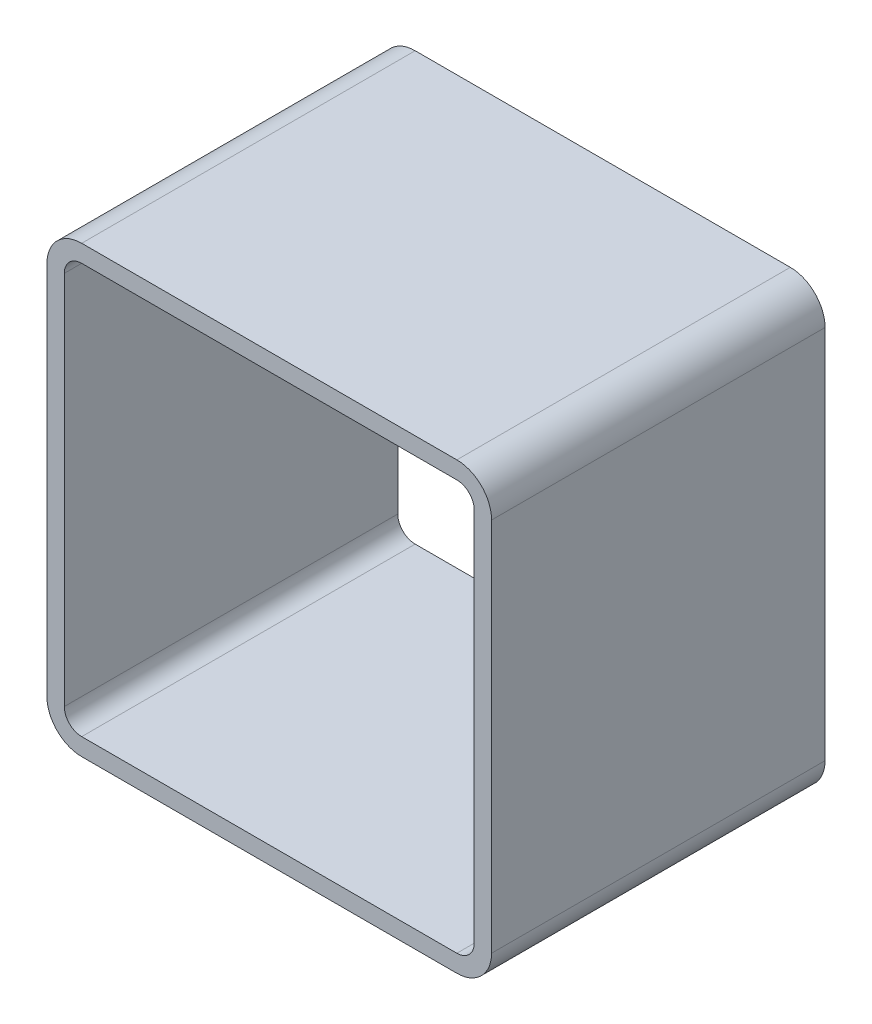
ISO-10303-21;
HEADER;
FILE_DESCRIPTION(('STEP AP214'),'2;1');
FILE_NAME('part.step','',(''),(''),'','','');
FILE_SCHEMA(('AUTOMOTIVE_DESIGN { 1 0 10303 214 1 1 1 1 }'));
ENDSEC;
DATA;
#1=APPLICATION_CONTEXT('core data for automotive mechanical design processes');
#2=APPLICATION_PROTOCOL_DEFINITION('international standard','automotive_design',2000,#1);
#3=PRODUCT_CONTEXT('',#1,'mechanical');
#4=PRODUCT('Part','Part','',(#3));
#5=PRODUCT_RELATED_PRODUCT_CATEGORY('part','',(#4));
#6=PRODUCT_DEFINITION_FORMATION('','',#4);
#7=PRODUCT_DEFINITION_CONTEXT('part definition',#1,'design');
#8=PRODUCT_DEFINITION('design','',#6,#7);
#9=PRODUCT_DEFINITION_SHAPE('','',#8);
#10=(LENGTH_UNIT() NAMED_UNIT(*) SI_UNIT(.MILLI.,.METRE.));
#11=(NAMED_UNIT(*) PLANE_ANGLE_UNIT() SI_UNIT($,.RADIAN.));
#12=(NAMED_UNIT(*) SI_UNIT($,.STERADIAN.) SOLID_ANGLE_UNIT());
#13=UNCERTAINTY_MEASURE_WITH_UNIT(LENGTH_MEASURE(1.E-05),#10,'distance_accuracy_value','');
#14=(GEOMETRIC_REPRESENTATION_CONTEXT(3) GLOBAL_UNCERTAINTY_ASSIGNED_CONTEXT((#13)) GLOBAL_UNIT_ASSIGNED_CONTEXT((#10,
#11,#12)) REPRESENTATION_CONTEXT('',''));
#15=CARTESIAN_POINT('',(0.,0.,0.));
#16=DIRECTION('',(0.,0.,1.));
#17=DIRECTION('',(1.,0.,0.));
#18=AXIS2_PLACEMENT_3D('',#15,#16,#17);
#19=CARTESIAN_POINT('',(375.472465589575,33.5328624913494,304.8));
#20=DIRECTION('',(0.,0.,1.));
#21=DIRECTION('',(1.,0.,0.));
#22=AXIS2_PLACEMENT_3D('',#19,#20,#21);
#23=PLANE('',#22);
#24=CARTESIAN_POINT('',(375.472465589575,33.5328624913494,304.8));
#25=DIRECTION('',(0.,0.,1.));
#26=DIRECTION('',(1.,0.,0.));
#27=AXIS2_PLACEMENT_3D('',#24,#25,#26);
#28=CIRCLE('',#27,31.75);
#29=CARTESIAN_POINT('',(375.472465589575,1.78286249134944,304.8));
#30=VERTEX_POINT('',#29);
#31=CARTESIAN_POINT('',(407.222465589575,33.5328624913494,304.8));
#32=VERTEX_POINT('',#31);
#33=EDGE_CURVE('E211',#30,#32,#28,.T.);
#34=ORIENTED_EDGE('',*,*,#33,.T.);
#35=DIRECTION('',(0.,1.,0.));
#36=VECTOR('',#35,1.);
#37=CARTESIAN_POINT('',(407.222465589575,376.432862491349,304.8));
#38=LINE('',#37,#36);
#39=CARTESIAN_POINT('',(407.222465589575,376.432862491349,304.8));
#40=VERTEX_POINT('',#39);
#41=EDGE_CURVE('E214',#32,#40,#38,.T.);
#42=ORIENTED_EDGE('',*,*,#41,.T.);
#43=CARTESIAN_POINT('',(375.472465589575,376.432862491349,304.8));
#44=DIRECTION('',(0.,0.,1.));
#45=DIRECTION('',(1.,0.,0.));
#46=AXIS2_PLACEMENT_3D('',#43,#44,#45);
#47=CIRCLE('',#46,31.75);
#48=CARTESIAN_POINT('',(375.472465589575,408.182862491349,304.8));
#49=VERTEX_POINT('',#48);
#50=EDGE_CURVE('E217',#40,#49,#47,.T.);
#51=ORIENTED_EDGE('',*,*,#50,.T.);
#52=DIRECTION('',(-1.,0.,0.));
#53=VECTOR('',#52,1.);
#54=CARTESIAN_POINT('',(32.572465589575,408.182862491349,304.8));
#55=LINE('',#54,#53);
#56=CARTESIAN_POINT('',(32.572465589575,408.182862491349,304.8));
#57=VERTEX_POINT('',#56);
#58=EDGE_CURVE('E219',#49,#57,#55,.T.);
#59=ORIENTED_EDGE('',*,*,#58,.T.);
#60=CARTESIAN_POINT('',(32.572465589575,376.432862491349,304.8));
#61=DIRECTION('',(0.,0.,1.));
#62=DIRECTION('',(1.,0.,0.));
#63=AXIS2_PLACEMENT_3D('',#60,#61,#62);
#64=CIRCLE('',#63,31.75);
#65=CARTESIAN_POINT('',(0.82246558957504,376.432862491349,304.8));
#66=VERTEX_POINT('',#65);
#67=EDGE_CURVE('E221',#57,#66,#64,.T.);
#68=ORIENTED_EDGE('',*,*,#67,.T.);
#69=DIRECTION('',(0.,-1.,0.));
#70=VECTOR('',#69,1.);
#71=CARTESIAN_POINT('',(0.82246558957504,33.5328624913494,304.8));
#72=LINE('',#71,#70);
#73=CARTESIAN_POINT('',(0.822465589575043,33.5328624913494,304.8));
#74=VERTEX_POINT('',#73);
#75=EDGE_CURVE('E223',#66,#74,#72,.T.);
#76=ORIENTED_EDGE('',*,*,#75,.T.);
#77=CARTESIAN_POINT('',(32.572465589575,33.5328624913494,304.8));
#78=DIRECTION('',(0.,0.,1.));
#79=DIRECTION('',(1.,0.,0.));
#80=AXIS2_PLACEMENT_3D('',#77,#78,#79);
#81=CIRCLE('',#80,31.75);
#82=CARTESIAN_POINT('',(32.572465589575,1.78286249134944,304.8));
#83=VERTEX_POINT('',#82);
#84=EDGE_CURVE('E225',#74,#83,#81,.T.);
#85=ORIENTED_EDGE('',*,*,#84,.T.);
#86=DIRECTION('',(1.,0.,0.));
#87=VECTOR('',#86,1.);
#88=CARTESIAN_POINT('',(375.472465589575,1.78286249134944,304.8));
#89=LINE('',#88,#87);
#90=EDGE_CURVE('E227',#83,#30,#89,.T.);
#91=ORIENTED_EDGE('',*,*,#90,.T.);
#92=EDGE_LOOP('',(#34,#42,#51,#59,#68,#76,#85,#91));
#93=FACE_BOUND('',#92,.T.);
#94=DIRECTION('',(0.,-1.,0.));
#95=VECTOR('',#94,1.);
#96=CARTESIAN_POINT('',(16.697465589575,33.5328624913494,304.8));
#97=LINE('',#96,#95);
#98=CARTESIAN_POINT('',(16.697465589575,376.432862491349,304.8));
#99=VERTEX_POINT('',#98);
#100=CARTESIAN_POINT('',(16.697465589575,33.5328624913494,304.8));
#101=VERTEX_POINT('',#100);
#102=EDGE_CURVE('E154',#99,#101,#97,.T.);
#103=ORIENTED_EDGE('',*,*,#102,.F.);
#104=CARTESIAN_POINT('',(32.572465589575,376.432862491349,304.8));
#105=DIRECTION('',(0.,0.,1.));
#106=DIRECTION('',(1.,0.,0.));
#107=AXIS2_PLACEMENT_3D('',#104,#105,#106);
#108=CIRCLE('',#107,15.875);
#109=CARTESIAN_POINT('',(32.572465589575,392.307862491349,304.8));
#110=VERTEX_POINT('',#109);
#111=EDGE_CURVE('E146',#110,#99,#108,.T.);
#112=ORIENTED_EDGE('',*,*,#111,.F.);
#113=DIRECTION('',(-1.,0.,0.));
#114=VECTOR('',#113,1.);
#115=CARTESIAN_POINT('',(32.572465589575,392.307862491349,304.8));
#116=LINE('',#115,#114);
#117=CARTESIAN_POINT('',(375.472465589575,392.307862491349,304.8));
#118=VERTEX_POINT('',#117);
#119=EDGE_CURVE('E179',#118,#110,#116,.T.);
#120=ORIENTED_EDGE('',*,*,#119,.F.);
#121=CARTESIAN_POINT('',(375.472465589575,376.432862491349,304.8));
#122=DIRECTION('',(0.,0.,1.));
#123=DIRECTION('',(1.,0.,0.));
#124=AXIS2_PLACEMENT_3D('',#121,#122,#123);
#125=CIRCLE('',#124,15.8750000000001);
#126=CARTESIAN_POINT('',(391.347465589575,376.432862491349,304.8));
#127=VERTEX_POINT('',#126);
#128=EDGE_CURVE('E177',#127,#118,#125,.T.);
#129=ORIENTED_EDGE('',*,*,#128,.F.);
#130=DIRECTION('',(0.,1.,0.));
#131=VECTOR('',#130,1.);
#132=CARTESIAN_POINT('',(391.347465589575,376.432862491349,304.8));
#133=LINE('',#132,#131);
#134=CARTESIAN_POINT('',(391.347465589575,33.5328624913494,304.8));
#135=VERTEX_POINT('',#134);
#136=EDGE_CURVE('E175',#135,#127,#133,.T.);
#137=ORIENTED_EDGE('',*,*,#136,.F.);
#138=CARTESIAN_POINT('',(375.472465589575,33.5328624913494,304.8));
#139=DIRECTION('',(0.,0.,1.));
#140=DIRECTION('',(1.,0.,0.));
#141=AXIS2_PLACEMENT_3D('',#138,#139,#140);
#142=CIRCLE('',#141,15.875);
#143=CARTESIAN_POINT('',(375.472465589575,17.6578624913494,304.8));
#144=VERTEX_POINT('',#143);
#145=EDGE_CURVE('E173',#144,#135,#142,.T.);
#146=ORIENTED_EDGE('',*,*,#145,.F.);
#147=DIRECTION('',(1.,0.,0.));
#148=VECTOR('',#147,1.);
#149=CARTESIAN_POINT('',(375.472465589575,17.6578624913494,304.8));
#150=LINE('',#149,#148);
#151=CARTESIAN_POINT('',(32.572465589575,17.6578624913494,304.8));
#152=VERTEX_POINT('',#151);
#153=EDGE_CURVE('E169',#152,#144,#150,.T.);
#154=ORIENTED_EDGE('',*,*,#153,.F.);
#155=CARTESIAN_POINT('',(32.572465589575,33.5328624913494,304.8));
#156=DIRECTION('',(0.,0.,1.));
#157=DIRECTION('',(1.,0.,0.));
#158=AXIS2_PLACEMENT_3D('',#155,#156,#157);
#159=CIRCLE('',#158,15.875);
#160=EDGE_CURVE('E167',#101,#152,#159,.T.);
#161=ORIENTED_EDGE('',*,*,#160,.F.);
#162=EDGE_LOOP('',(#103,#112,#120,#129,#137,#146,#154,#161));
#163=FACE_BOUND('',#162,.T.);
#164=ADVANCED_FACE('F33',(#93,#163),#23,.T.);
#165=CARTESIAN_POINT('',(375.472465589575,33.5328624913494,0.));
#166=DIRECTION('',(0.,0.,1.));
#167=DIRECTION('',(1.,0.,0.));
#168=AXIS2_PLACEMENT_3D('',#165,#166,#167);
#169=PLANE('',#168);
#170=CARTESIAN_POINT('',(375.472465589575,33.5328624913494,0.));
#171=DIRECTION('',(0.,0.,1.));
#172=DIRECTION('',(1.,0.,0.));
#173=AXIS2_PLACEMENT_3D('',#170,#171,#172);
#174=CIRCLE('',#173,31.75);
#175=CARTESIAN_POINT('',(375.472465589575,1.78286249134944,0.));
#176=VERTEX_POINT('',#175);
#177=CARTESIAN_POINT('',(407.222465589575,33.5328624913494,0.));
#178=VERTEX_POINT('',#177);
#179=EDGE_CURVE('E162',#176,#178,#174,.T.);
#180=ORIENTED_EDGE('',*,*,#179,.F.);
#181=DIRECTION('',(1.,0.,0.));
#182=VECTOR('',#181,1.);
#183=CARTESIAN_POINT('',(375.472465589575,1.78286249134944,0.));
#184=LINE('',#183,#182);
#185=CARTESIAN_POINT('',(32.572465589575,1.78286249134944,0.));
#186=VERTEX_POINT('',#185);
#187=EDGE_CURVE('E215',#186,#176,#184,.T.);
#188=ORIENTED_EDGE('',*,*,#187,.F.);
#189=CARTESIAN_POINT('',(32.572465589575,33.5328624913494,0.));
#190=DIRECTION('',(0.,0.,1.));
#191=DIRECTION('',(1.,0.,0.));
#192=AXIS2_PLACEMENT_3D('',#189,#190,#191);
#193=CIRCLE('',#192,31.75);
#194=CARTESIAN_POINT('',(0.822465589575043,33.5328624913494,0.));
#195=VERTEX_POINT('',#194);
#196=EDGE_CURVE('E242',#195,#186,#193,.T.);
#197=ORIENTED_EDGE('',*,*,#196,.F.);
#198=DIRECTION('',(0.,-1.,0.));
#199=VECTOR('',#198,1.);
#200=CARTESIAN_POINT('',(0.82246558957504,33.5328624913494,0.));
#201=LINE('',#200,#199);
#202=CARTESIAN_POINT('',(0.82246558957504,376.432862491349,0.));
#203=VERTEX_POINT('',#202);
#204=EDGE_CURVE('E240',#203,#195,#201,.T.);
#205=ORIENTED_EDGE('',*,*,#204,.F.);
#206=CARTESIAN_POINT('',(32.572465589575,376.432862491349,0.));
#207=DIRECTION('',(0.,0.,1.));
#208=DIRECTION('',(1.,0.,0.));
#209=AXIS2_PLACEMENT_3D('',#206,#207,#208);
#210=CIRCLE('',#209,31.75);
#211=CARTESIAN_POINT('',(32.572465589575,408.182862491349,0.));
#212=VERTEX_POINT('',#211);
#213=EDGE_CURVE('E238',#212,#203,#210,.T.);
#214=ORIENTED_EDGE('',*,*,#213,.F.);
#215=DIRECTION('',(-1.,0.,0.));
#216=VECTOR('',#215,1.);
#217=CARTESIAN_POINT('',(32.572465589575,408.182862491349,0.));
#218=LINE('',#217,#216);
#219=CARTESIAN_POINT('',(375.472465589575,408.182862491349,0.));
#220=VERTEX_POINT('',#219);
#221=EDGE_CURVE('E236',#220,#212,#218,.T.);
#222=ORIENTED_EDGE('',*,*,#221,.F.);
#223=CARTESIAN_POINT('',(375.472465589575,376.432862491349,0.));
#224=DIRECTION('',(0.,0.,1.));
#225=DIRECTION('',(1.,0.,0.));
#226=AXIS2_PLACEMENT_3D('',#223,#224,#225);
#227=CIRCLE('',#226,31.75);
#228=CARTESIAN_POINT('',(407.222465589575,376.432862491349,0.));
#229=VERTEX_POINT('',#228);
#230=EDGE_CURVE('E234',#229,#220,#227,.T.);
#231=ORIENTED_EDGE('',*,*,#230,.F.);
#232=DIRECTION('',(0.,1.,0.));
#233=VECTOR('',#232,1.);
#234=CARTESIAN_POINT('',(407.222465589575,376.432862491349,0.));
#235=LINE('',#234,#233);
#236=EDGE_CURVE('E232',#178,#229,#235,.T.);
#237=ORIENTED_EDGE('',*,*,#236,.F.);
#238=EDGE_LOOP('',(#180,#188,#197,#205,#214,#222,#231,#237));
#239=FACE_BOUND('',#238,.T.);
#240=CARTESIAN_POINT('',(32.572465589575,376.432862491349,0.));
#241=DIRECTION('',(0.,0.,1.));
#242=DIRECTION('',(1.,0.,0.));
#243=AXIS2_PLACEMENT_3D('',#240,#241,#242);
#244=CIRCLE('',#243,15.875);
#245=CARTESIAN_POINT('',(32.572465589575,392.307862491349,0.));
#246=VERTEX_POINT('',#245);
#247=CARTESIAN_POINT('',(16.697465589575,376.432862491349,0.));
#248=VERTEX_POINT('',#247);
#249=EDGE_CURVE('E56',#246,#248,#244,.T.);
#250=ORIENTED_EDGE('',*,*,#249,.T.);
#251=DIRECTION('',(0.,-1.,0.));
#252=VECTOR('',#251,1.);
#253=CARTESIAN_POINT('',(16.697465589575,33.5328624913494,0.));
#254=LINE('',#253,#252);
#255=CARTESIAN_POINT('',(16.697465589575,33.5328624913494,0.));
#256=VERTEX_POINT('',#255);
#257=EDGE_CURVE('E161',#248,#256,#254,.T.);
#258=ORIENTED_EDGE('',*,*,#257,.T.);
#259=CARTESIAN_POINT('',(32.572465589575,33.5328624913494,0.));
#260=DIRECTION('',(0.,0.,1.));
#261=DIRECTION('',(1.,0.,0.));
#262=AXIS2_PLACEMENT_3D('',#259,#260,#261);
#263=CIRCLE('',#262,15.875);
#264=CARTESIAN_POINT('',(32.572465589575,17.6578624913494,0.));
#265=VERTEX_POINT('',#264);
#266=EDGE_CURVE('E183',#256,#265,#263,.T.);
#267=ORIENTED_EDGE('',*,*,#266,.T.);
#268=DIRECTION('',(1.,0.,0.));
#269=VECTOR('',#268,1.);
#270=CARTESIAN_POINT('',(375.472465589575,17.6578624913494,0.));
#271=LINE('',#270,#269);
#272=CARTESIAN_POINT('',(375.472465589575,17.6578624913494,0.));
#273=VERTEX_POINT('',#272);
#274=EDGE_CURVE('E186',#265,#273,#271,.T.);
#275=ORIENTED_EDGE('',*,*,#274,.T.);
#276=CARTESIAN_POINT('',(375.472465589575,33.5328624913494,0.));
#277=DIRECTION('',(0.,0.,1.));
#278=DIRECTION('',(1.,0.,0.));
#279=AXIS2_PLACEMENT_3D('',#276,#277,#278);
#280=CIRCLE('',#279,15.875);
#281=CARTESIAN_POINT('',(391.347465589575,33.5328624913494,0.));
#282=VERTEX_POINT('',#281);
#283=EDGE_CURVE('E189',#273,#282,#280,.T.);
#284=ORIENTED_EDGE('',*,*,#283,.T.);
#285=DIRECTION('',(0.,1.,0.));
#286=VECTOR('',#285,1.);
#287=CARTESIAN_POINT('',(391.347465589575,376.432862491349,0.));
#288=LINE('',#287,#286);
#289=CARTESIAN_POINT('',(391.347465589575,376.432862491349,0.));
#290=VERTEX_POINT('',#289);
#291=EDGE_CURVE('E192',#282,#290,#288,.T.);
#292=ORIENTED_EDGE('',*,*,#291,.T.);
#293=CARTESIAN_POINT('',(375.472465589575,376.432862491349,0.));
#294=DIRECTION('',(0.,0.,1.));
#295=DIRECTION('',(1.,0.,0.));
#296=AXIS2_PLACEMENT_3D('',#293,#294,#295);
#297=CIRCLE('',#296,15.8750000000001);
#298=CARTESIAN_POINT('',(375.472465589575,392.307862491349,0.));
#299=VERTEX_POINT('',#298);
#300=EDGE_CURVE('E195',#290,#299,#297,.T.);
#301=ORIENTED_EDGE('',*,*,#300,.T.);
#302=DIRECTION('',(-1.,0.,0.));
#303=VECTOR('',#302,1.);
#304=CARTESIAN_POINT('',(32.572465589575,392.307862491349,0.));
#305=LINE('',#304,#303);
#306=EDGE_CURVE('E155',#299,#246,#305,.T.);
#307=ORIENTED_EDGE('',*,*,#306,.T.);
#308=EDGE_LOOP('',(#250,#258,#267,#275,#284,#292,#301,#307));
#309=FACE_BOUND('',#308,.T.);
#310=ADVANCED_FACE('F272',(#239,#309),#169,.F.);
#311=CARTESIAN_POINT('',(375.472465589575,33.5328624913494,304.8));
#312=DIRECTION('',(0.,0.,-1.));
#313=DIRECTION('',(-1.,0.,0.));
#314=AXIS2_PLACEMENT_3D('',#311,#312,#313);
#315=CYLINDRICAL_SURFACE('',#314,31.75);
#316=ORIENTED_EDGE('',*,*,#179,.T.);
#317=DIRECTION('',(0.,0.,-1.));
#318=VECTOR('',#317,1.);
#319=CARTESIAN_POINT('',(407.222465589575,33.5328624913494,304.8));
#320=LINE('',#319,#318);
#321=EDGE_CURVE('E11',#32,#178,#320,.T.);
#322=ORIENTED_EDGE('',*,*,#321,.F.);
#323=ORIENTED_EDGE('',*,*,#33,.F.);
#324=DIRECTION('',(0.,0.,-1.));
#325=VECTOR('',#324,1.);
#326=CARTESIAN_POINT('',(375.472465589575,1.78286249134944,304.8));
#327=LINE('',#326,#325);
#328=EDGE_CURVE('E229',#30,#176,#327,.T.);
#329=ORIENTED_EDGE('',*,*,#328,.T.);
#330=EDGE_LOOP('',(#316,#322,#323,#329));
#331=FACE_BOUND('',#330,.T.);
#332=ADVANCED_FACE('F35',(#331),#315,.T.);
#333=CARTESIAN_POINT('',(407.222465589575,376.432862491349,304.8));
#334=DIRECTION('',(-1.,0.,0.));
#335=DIRECTION('',(0.,0.,1.));
#336=AXIS2_PLACEMENT_3D('',#333,#334,#335);
#337=PLANE('',#336);
#338=ORIENTED_EDGE('',*,*,#236,.T.);
#339=DIRECTION('',(0.,0.,-1.));
#340=VECTOR('',#339,1.);
#341=CARTESIAN_POINT('',(407.222465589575,376.432862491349,304.8));
#342=LINE('',#341,#340);
#343=EDGE_CURVE('E41',#40,#229,#342,.T.);
#344=ORIENTED_EDGE('',*,*,#343,.F.);
#345=ORIENTED_EDGE('',*,*,#41,.F.);
#346=ORIENTED_EDGE('',*,*,#321,.T.);
#347=EDGE_LOOP('',(#338,#344,#345,#346));
#348=FACE_BOUND('',#347,.T.);
#349=ADVANCED_FACE('F289',(#348),#337,.F.);
#350=CARTESIAN_POINT('',(375.472465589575,376.432862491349,304.8));
#351=DIRECTION('',(0.,0.,-1.));
#352=DIRECTION('',(-1.,0.,0.));
#353=AXIS2_PLACEMENT_3D('',#350,#351,#352);
#354=CYLINDRICAL_SURFACE('',#353,31.75);
#355=ORIENTED_EDGE('',*,*,#230,.T.);
#356=DIRECTION('',(0.,0.,-1.));
#357=VECTOR('',#356,1.);
#358=CARTESIAN_POINT('',(375.472465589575,408.182862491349,304.8));
#359=LINE('',#358,#357);
#360=EDGE_CURVE('E259',#49,#220,#359,.T.);
#361=ORIENTED_EDGE('',*,*,#360,.F.);
#362=ORIENTED_EDGE('',*,*,#50,.F.);
#363=ORIENTED_EDGE('',*,*,#343,.T.);
#364=EDGE_LOOP('',(#355,#361,#362,#363));
#365=FACE_BOUND('',#364,.T.);
#366=ADVANCED_FACE('F266',(#365),#354,.T.);
#367=CARTESIAN_POINT('',(32.572465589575,408.182862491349,304.8));
#368=DIRECTION('',(0.,-1.,0.));
#369=DIRECTION('',(0.,0.,-1.));
#370=AXIS2_PLACEMENT_3D('',#367,#368,#369);
#371=PLANE('',#370);
#372=ORIENTED_EDGE('',*,*,#221,.T.);
#373=DIRECTION('',(0.,0.,-1.));
#374=VECTOR('',#373,1.);
#375=CARTESIAN_POINT('',(32.572465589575,408.182862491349,304.8));
#376=LINE('',#375,#374);
#377=EDGE_CURVE('E256',#57,#212,#376,.T.);
#378=ORIENTED_EDGE('',*,*,#377,.F.);
#379=ORIENTED_EDGE('',*,*,#58,.F.);
#380=ORIENTED_EDGE('',*,*,#360,.T.);
#381=EDGE_LOOP('',(#372,#378,#379,#380));
#382=FACE_BOUND('',#381,.T.);
#383=ADVANCED_FACE('F278',(#382),#371,.F.);
#384=CARTESIAN_POINT('',(32.572465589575,376.432862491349,304.8));
#385=DIRECTION('',(0.,0.,-1.));
#386=DIRECTION('',(-1.,0.,0.));
#387=AXIS2_PLACEMENT_3D('',#384,#385,#386);
#388=CYLINDRICAL_SURFACE('',#387,31.75);
#389=ORIENTED_EDGE('',*,*,#213,.T.);
#390=DIRECTION('',(0.,0.,-1.));
#391=VECTOR('',#390,1.);
#392=CARTESIAN_POINT('',(0.82246558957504,376.432862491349,304.8));
#393=LINE('',#392,#391);
#394=EDGE_CURVE('E253',#66,#203,#393,.T.);
#395=ORIENTED_EDGE('',*,*,#394,.F.);
#396=ORIENTED_EDGE('',*,*,#67,.F.);
#397=ORIENTED_EDGE('',*,*,#377,.T.);
#398=EDGE_LOOP('',(#389,#395,#396,#397));
#399=FACE_BOUND('',#398,.T.);
#400=ADVANCED_FACE('F282',(#399),#388,.T.);
#401=CARTESIAN_POINT('',(0.82246558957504,33.5328624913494,304.8));
#402=DIRECTION('',(1.,0.,0.));
#403=DIRECTION('',(0.,0.,-1.));
#404=AXIS2_PLACEMENT_3D('',#401,#402,#403);
#405=PLANE('',#404);
#406=ORIENTED_EDGE('',*,*,#204,.T.);
#407=DIRECTION('',(0.,0.,-1.));
#408=VECTOR('',#407,1.);
#409=CARTESIAN_POINT('',(0.822465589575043,33.5328624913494,304.8));
#410=LINE('',#409,#408);
#411=EDGE_CURVE('E250',#74,#195,#410,.T.);
#412=ORIENTED_EDGE('',*,*,#411,.F.);
#413=ORIENTED_EDGE('',*,*,#75,.F.);
#414=ORIENTED_EDGE('',*,*,#394,.T.);
#415=EDGE_LOOP('',(#406,#412,#413,#414));
#416=FACE_BOUND('',#415,.T.);
#417=ADVANCED_FACE('F302',(#416),#405,.F.);
#418=CARTESIAN_POINT('',(32.572465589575,33.5328624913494,304.8));
#419=DIRECTION('',(0.,0.,-1.));
#420=DIRECTION('',(-1.,0.,0.));
#421=AXIS2_PLACEMENT_3D('',#418,#419,#420);
#422=CYLINDRICAL_SURFACE('',#421,31.75);
#423=ORIENTED_EDGE('',*,*,#196,.T.);
#424=DIRECTION('',(0.,0.,-1.));
#425=VECTOR('',#424,1.);
#426=CARTESIAN_POINT('',(32.572465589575,1.78286249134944,304.8));
#427=LINE('',#426,#425);
#428=EDGE_CURVE('E247',#83,#186,#427,.T.);
#429=ORIENTED_EDGE('',*,*,#428,.F.);
#430=ORIENTED_EDGE('',*,*,#84,.F.);
#431=ORIENTED_EDGE('',*,*,#411,.T.);
#432=EDGE_LOOP('',(#423,#429,#430,#431));
#433=FACE_BOUND('',#432,.T.);
#434=ADVANCED_FACE('F300',(#433),#422,.T.);
#435=CARTESIAN_POINT('',(375.472465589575,1.78286249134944,304.8));
#436=DIRECTION('',(0.,1.,0.));
#437=DIRECTION('',(0.,0.,1.));
#438=AXIS2_PLACEMENT_3D('',#435,#436,#437);
#439=PLANE('',#438);
#440=ORIENTED_EDGE('',*,*,#187,.T.);
#441=ORIENTED_EDGE('',*,*,#328,.F.);
#442=ORIENTED_EDGE('',*,*,#90,.F.);
#443=ORIENTED_EDGE('',*,*,#428,.T.);
#444=EDGE_LOOP('',(#440,#441,#442,#443));
#445=FACE_BOUND('',#444,.T.);
#446=ADVANCED_FACE('F295',(#445),#439,.F.);
#447=CARTESIAN_POINT('',(32.572465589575,376.432862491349,304.8));
#448=DIRECTION('',(0.,0.,-1.));
#449=DIRECTION('',(-1.,0.,0.));
#450=AXIS2_PLACEMENT_3D('',#447,#448,#449);
#451=CYLINDRICAL_SURFACE('',#450,15.875);
#452=ORIENTED_EDGE('',*,*,#249,.F.);
#453=DIRECTION('',(0.,0.,-1.));
#454=VECTOR('',#453,1.);
#455=CARTESIAN_POINT('',(32.572465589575,392.307862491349,304.8));
#456=LINE('',#455,#454);
#457=EDGE_CURVE('E150',#110,#246,#456,.T.);
#458=ORIENTED_EDGE('',*,*,#457,.F.);
#459=ORIENTED_EDGE('',*,*,#111,.T.);
#460=DIRECTION('',(0.,0.,-1.));
#461=VECTOR('',#460,1.);
#462=CARTESIAN_POINT('',(16.697465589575,376.432862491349,304.8));
#463=LINE('',#462,#461);
#464=EDGE_CURVE('E149',#99,#248,#463,.T.);
#465=ORIENTED_EDGE('',*,*,#464,.T.);
#466=EDGE_LOOP('',(#452,#458,#459,#465));
#467=FACE_BOUND('',#466,.T.);
#468=ADVANCED_FACE('F148',(#467),#451,.F.);
#469=CARTESIAN_POINT('',(16.697465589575,33.5328624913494,304.8));
#470=DIRECTION('',(1.,0.,0.));
#471=DIRECTION('',(0.,0.,-1.));
#472=AXIS2_PLACEMENT_3D('',#469,#470,#471);
#473=PLANE('',#472);
#474=ORIENTED_EDGE('',*,*,#257,.F.);
#475=ORIENTED_EDGE('',*,*,#464,.F.);
#476=ORIENTED_EDGE('',*,*,#102,.T.);
#477=DIRECTION('',(0.,0.,-1.));
#478=VECTOR('',#477,1.);
#479=CARTESIAN_POINT('',(16.697465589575,33.5328624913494,304.8));
#480=LINE('',#479,#478);
#481=EDGE_CURVE('E163',#101,#256,#480,.T.);
#482=ORIENTED_EDGE('',*,*,#481,.T.);
#483=EDGE_LOOP('',(#474,#475,#476,#482));
#484=FACE_BOUND('',#483,.T.);
#485=ADVANCED_FACE('F158',(#484),#473,.T.);
#486=CARTESIAN_POINT('',(32.572465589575,33.5328624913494,304.8));
#487=DIRECTION('',(0.,0.,-1.));
#488=DIRECTION('',(-1.,0.,0.));
#489=AXIS2_PLACEMENT_3D('',#486,#487,#488);
#490=CYLINDRICAL_SURFACE('',#489,15.875);
#491=ORIENTED_EDGE('',*,*,#266,.F.);
#492=ORIENTED_EDGE('',*,*,#481,.F.);
#493=ORIENTED_EDGE('',*,*,#160,.T.);
#494=DIRECTION('',(0.,0.,-1.));
#495=VECTOR('',#494,1.);
#496=CARTESIAN_POINT('',(32.572465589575,17.6578624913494,304.8));
#497=LINE('',#496,#495);
#498=EDGE_CURVE('E208',#152,#265,#497,.T.);
#499=ORIENTED_EDGE('',*,*,#498,.T.);
#500=EDGE_LOOP('',(#491,#492,#493,#499));
#501=FACE_BOUND('',#500,.T.);
#502=ADVANCED_FACE('F327',(#501),#490,.F.);
#503=CARTESIAN_POINT('',(375.472465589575,17.6578624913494,304.8));
#504=DIRECTION('',(0.,1.,0.));
#505=DIRECTION('',(0.,0.,1.));
#506=AXIS2_PLACEMENT_3D('',#503,#504,#505);
#507=PLANE('',#506);
#508=ORIENTED_EDGE('',*,*,#274,.F.);
#509=ORIENTED_EDGE('',*,*,#498,.F.);
#510=ORIENTED_EDGE('',*,*,#153,.T.);
#511=DIRECTION('',(0.,0.,-1.));
#512=VECTOR('',#511,1.);
#513=CARTESIAN_POINT('',(375.472465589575,17.6578624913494,304.8));
#514=LINE('',#513,#512);
#515=EDGE_CURVE('E206',#144,#273,#514,.T.);
#516=ORIENTED_EDGE('',*,*,#515,.T.);
#517=EDGE_LOOP('',(#508,#509,#510,#516));
#518=FACE_BOUND('',#517,.T.);
#519=ADVANCED_FACE('F331',(#518),#507,.T.);
#520=CARTESIAN_POINT('',(375.472465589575,33.5328624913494,304.8));
#521=DIRECTION('',(0.,0.,-1.));
#522=DIRECTION('',(-1.,0.,0.));
#523=AXIS2_PLACEMENT_3D('',#520,#521,#522);
#524=CYLINDRICAL_SURFACE('',#523,15.875);
#525=ORIENTED_EDGE('',*,*,#283,.F.);
#526=ORIENTED_EDGE('',*,*,#515,.F.);
#527=ORIENTED_EDGE('',*,*,#145,.T.);
#528=DIRECTION('',(0.,0.,-1.));
#529=VECTOR('',#528,1.);
#530=CARTESIAN_POINT('',(391.347465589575,33.5328624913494,304.8));
#531=LINE('',#530,#529);
#532=EDGE_CURVE('E204',#135,#282,#531,.T.);
#533=ORIENTED_EDGE('',*,*,#532,.T.);
#534=EDGE_LOOP('',(#525,#526,#527,#533));
#535=FACE_BOUND('',#534,.T.);
#536=ADVANCED_FACE('F337',(#535),#524,.F.);
#537=CARTESIAN_POINT('',(391.347465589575,376.432862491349,304.8));
#538=DIRECTION('',(-1.,0.,0.));
#539=DIRECTION('',(0.,0.,1.));
#540=AXIS2_PLACEMENT_3D('',#537,#538,#539);
#541=PLANE('',#540);
#542=ORIENTED_EDGE('',*,*,#291,.F.);
#543=ORIENTED_EDGE('',*,*,#532,.F.);
#544=ORIENTED_EDGE('',*,*,#136,.T.);
#545=DIRECTION('',(0.,0.,-1.));
#546=VECTOR('',#545,1.);
#547=CARTESIAN_POINT('',(391.347465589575,376.432862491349,304.8));
#548=LINE('',#547,#546);
#549=EDGE_CURVE('E202',#127,#290,#548,.T.);
#550=ORIENTED_EDGE('',*,*,#549,.T.);
#551=EDGE_LOOP('',(#542,#543,#544,#550));
#552=FACE_BOUND('',#551,.T.);
#553=ADVANCED_FACE('F341',(#552),#541,.T.);
#554=CARTESIAN_POINT('',(375.472465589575,376.432862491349,304.8));
#555=DIRECTION('',(0.,0.,-1.));
#556=DIRECTION('',(-1.,0.,0.));
#557=AXIS2_PLACEMENT_3D('',#554,#555,#556);
#558=CYLINDRICAL_SURFACE('',#557,15.8750000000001);
#559=ORIENTED_EDGE('',*,*,#300,.F.);
#560=ORIENTED_EDGE('',*,*,#549,.F.);
#561=ORIENTED_EDGE('',*,*,#128,.T.);
#562=DIRECTION('',(0.,0.,-1.));
#563=VECTOR('',#562,1.);
#564=CARTESIAN_POINT('',(375.472465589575,392.307862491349,304.8));
#565=LINE('',#564,#563);
#566=EDGE_CURVE('E48',#118,#299,#565,.T.);
#567=ORIENTED_EDGE('',*,*,#566,.T.);
#568=EDGE_LOOP('',(#559,#560,#561,#567));
#569=FACE_BOUND('',#568,.T.);
#570=ADVANCED_FACE('F345',(#569),#558,.F.);
#571=CARTESIAN_POINT('',(32.572465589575,392.307862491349,304.8));
#572=DIRECTION('',(0.,-1.,0.));
#573=DIRECTION('',(0.,0.,-1.));
#574=AXIS2_PLACEMENT_3D('',#571,#572,#573);
#575=PLANE('',#574);
#576=ORIENTED_EDGE('',*,*,#306,.F.);
#577=ORIENTED_EDGE('',*,*,#566,.F.);
#578=ORIENTED_EDGE('',*,*,#119,.T.);
#579=ORIENTED_EDGE('',*,*,#457,.T.);
#580=EDGE_LOOP('',(#576,#577,#578,#579));
#581=FACE_BOUND('',#580,.T.);
#582=ADVANCED_FACE('F349',(#581),#575,.T.);
#583=CLOSED_SHELL('',(#164,#310,#332,#349,#366,#383,#400,#417,#434,#446,#468,#485,#502,#519,
#536,#553,#570,#582));
#584=MANIFOLD_SOLID_BREP('B2',#583);
#585=ADVANCED_BREP_SHAPE_REPRESENTATION('',(#18,#584),#14);
#586=SHAPE_DEFINITION_REPRESENTATION(#9,#585);
ENDSEC;
END-ISO-10303-21;
